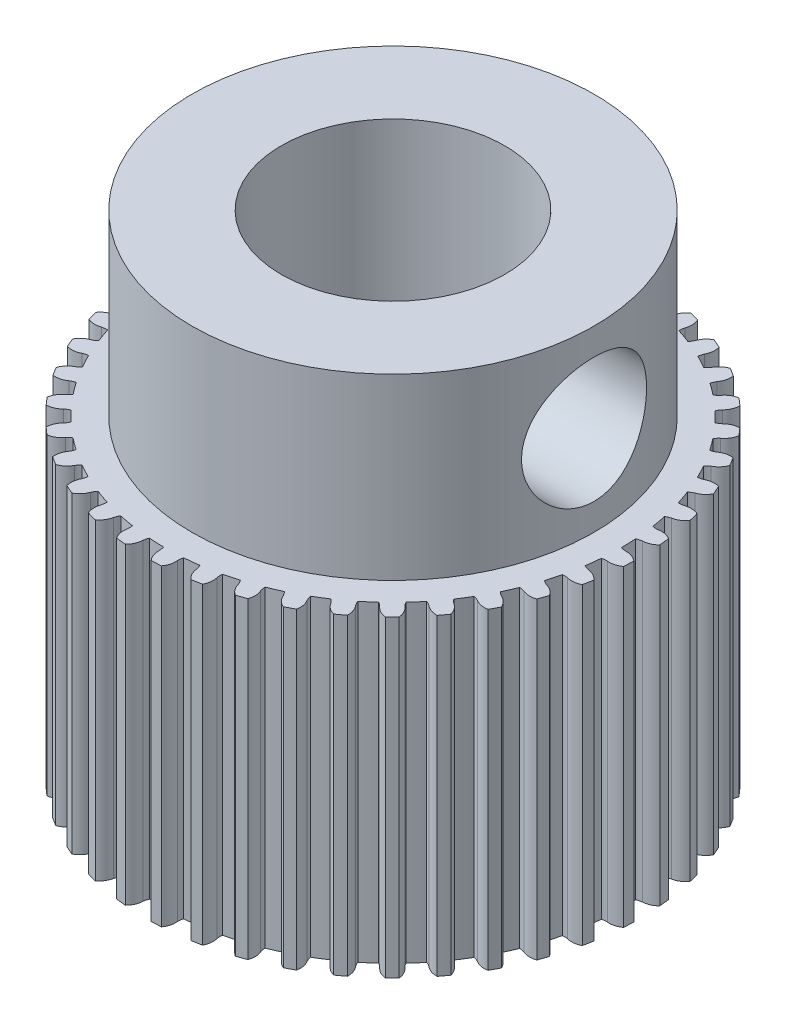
from build123d import *

# Parameters (mm, degrees)
CROQUIS1_R                 = 2.5
SALIENTE_EXTRUIR1_DEPTH    = 7
CROQUIS2_R                 = 4.5
CROQUIS2_R_2               = 2.5
SALIENTE_EXTRUIR2_DEPTH    = 4
CORTAR_EXTRUIR1_REACH      = 17.85
CORTAR_EXTRUIR1_END_RADIUS = 2.5
CROQUIS3_R                 = 1.4


with BuildPart() as part:
    # Croquis1 → Saliente-Extruir1 (new body)
    with BuildSketch(Plane(origin=(0, 0, 0), x_dir=(1, 0, 0), z_dir=(0, 1, 0))):
        with BuildLine():
            ThreePointArc((1.552531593, 4.983279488), (1.541147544, 4.923276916), (1.539030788, 4.86224066))
            ThreePointArc((1.539030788, 4.86224066), (1.694594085, 4.810233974), (1.848404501, 4.753251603))
            ThreePointArc((1.848404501, 4.753251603), (1.885012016, 4.802137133), (1.913750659, 4.856025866))
            ThreePointArc((1.913750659, 4.856025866), (1.989784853, 4.986597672), (2.108829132, 5.079649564))
            ThreePointArc((2.108829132, 5.079649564), (2.210056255, 5.036432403), (2.310398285, 4.991198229))
            ThreePointArc((2.310398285, 4.991198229), (2.322520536, 4.840588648), (2.277910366, 4.696227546))
            ThreePointArc((2.277910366, 4.696227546), (2.257710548, 4.638591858), (2.246520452, 4.578552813))
            ThreePointArc((2.246520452, 4.578552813), (2.392595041, 4.503941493), (2.53619474, 4.424671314))
            ThreePointArc((2.53619474, 4.424671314), (2.57967939, 4.467554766), (2.616128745, 4.516558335))
            ThreePointArc((2.616128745, 4.516558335), (2.710774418, 4.634339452), (2.842357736, 4.708609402))
            ThreePointArc((2.842357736, 4.708609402), (2.936013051, 4.650787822), (3.02849254, 4.591103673))
            ThreePointArc((3.02849254, 4.591103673), (3.018032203, 4.440369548), (2.952404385, 4.304269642))
            ThreePointArc((2.952404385, 4.304269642), (2.923840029, 4.250288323), (2.903826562, 4.192587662))
            ThreePointArc((2.903826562, 4.192587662), (3.037149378, 4.0970384), (3.16733058, 3.99725118))
            ThreePointArc((3.16733058, 3.99725118), (3.216720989, 4.033174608), (3.260066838, 4.076198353))
            ThreePointArc((3.260066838, 4.076198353), (3.371209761, 4.178557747), (3.512392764, 4.232386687))
            ThreePointArc((3.512392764, 4.232386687), (3.596384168, 4.161252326), (3.678935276, 4.088451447))
            ThreePointArc((3.678935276, 4.088451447), (3.646126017, 3.94095993), (3.560946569, 3.816161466))
            ThreePointArc((3.560946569, 3.816161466), (3.524655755, 3.76704037), (3.496265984, 3.71296703))
            ThreePointArc((3.496265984, 3.71296703), (3.613858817, 3.59861424), (3.727713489, 3.480539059))
            ThreePointArc((3.727713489, 3.480539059), (3.781906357, 3.508699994), (3.831180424, 3.544782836))
            ThreePointArc((3.831180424, 3.544782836), (3.95633785, 3.629433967), (4.103966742, 3.661619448))
            ThreePointArc((4.103966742, 3.661619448), (4.176418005, 3.578761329), (4.247196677, 3.494469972))
            ThreePointArc((4.247196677, 3.494469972), (4.1927714, 3.35351578), (4.089943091, 3.242806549))
            ThreePointArc((4.089943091, 3.242806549), (4.046736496, 3.19964296), (4.010604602, 3.150404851))
            ThreePointArc((4.010604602, 3.150404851), (4.109840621, 3.019802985), (4.204825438, 2.886077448))
            ThreePointArc((4.204825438, 2.886077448), (4.262610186, 2.90584682), (4.316711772, 2.934182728))
            ThreePointArc((4.316711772, 2.934182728), (4.453087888, 2.999234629), (4.603864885, 3.00905768))
            ThreePointArc((4.603864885, 3.00905768), (4.663157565, 2.916326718), (4.720582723, 2.822427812))
            ThreePointArc((4.720582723, 2.822427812), (4.6457572, 2.691159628), (4.527577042, 2.597012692))
            ThreePointArc((4.527577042, 2.597012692), (4.478419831, 2.560770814), (4.435352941, 2.517467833))
            ThreePointArc((4.435352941, 2.517467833), (4.514015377, 2.373534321), (4.588008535, 2.227145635))
            ThreePointArc((4.588008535, 2.227145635), (4.648094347, 2.23808183), (4.705814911, 2.258037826))
            ThreePointArc((4.705814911, 2.258037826), (4.850363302, 2.302037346), (5.000920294, 2.289278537))
            ThreePointArc((5.000920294, 2.289278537), (5.045729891, 2.188746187), (5.088518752, 2.087337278))
            ThreePointArc((5.088518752, 2.087337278), (4.99496446, 1.968687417), (4.864072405, 1.893205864))
            ThreePointArc((4.864072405, 1.893205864), (4.810062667, 1.864695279), (4.761022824, 1.828294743))
            ThreePointArc((4.761022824, 1.828294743), (4.817354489, 1.674244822), (4.868703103, 1.518463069))
            ThreePointArc((4.868703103, 1.518463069), (4.929747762, 1.52032179), (4.989797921, 1.531452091))
            ThreePointArc((4.989797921, 1.531452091), (5.139289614, 1.553416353), (5.286263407, 1.518360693))
            ThreePointArc((5.286263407, 1.518360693), (5.315588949, 1.412272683), (5.34278568, 1.305619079))
            ThreePointArc((5.34278568, 1.305619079), (5.232592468, 1.202237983), (5.091912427, 1.147107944))
            ThreePointArc((5.091912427, 1.147107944), (5.034256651, 1.126965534), (4.980339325, 1.098280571))
            ThreePointArc((4.980339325, 1.098280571), (5.013081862, 0.937555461), (5.040638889, 0.775860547))
            ThreePointArc((5.040638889, 0.775860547), (5.101278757, 0.768600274), (5.162317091, 0.770656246))
            ThreePointArc((5.162317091, 0.770656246), (5.313412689, 0.770094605), (5.453520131, 0.713525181))
            ThreePointArc((5.453520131, 0.713525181), (5.466706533, 0.604251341), (5.477703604, 0.494735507))
            ThreePointArc((5.477703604, 0.494735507), (5.353333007, 0.408932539), (5.20600754, 0.375385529))
            ThreePointArc((5.20600754, 0.375385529), (5.145993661, 0.36406124), (5.088403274, 0.343732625))
            ThreePointArc((5.088403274, 0.343732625), (5.09682527, 0.17992266), (5.099975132, 0.015926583))
            ThreePointArc((5.099975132, 0.015926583), (5.158855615, -0.000290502), (5.219518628, -0.007354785))
            ThreePointArc((5.219518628, -0.007354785), (5.368842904, -0.030429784), (5.498954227, -0.107249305))
            ThreePointArc((5.498954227, -0.107249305), (5.495706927, -0.217267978), (5.490258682, -0.327199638))
            ThreePointArc((5.490258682, -0.327199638), (5.354488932, -0.393507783), (5.203809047, -0.404722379))
            ThreePointArc((5.203809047, -0.404722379), (5.142777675, -0.40697558), (5.082800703, -0.41849374))
            ThreePointArc((5.082800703, -0.41849374), (5.066714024, -0.581729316), (5.045386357, -0.744363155))
            ThreePointArc((5.045386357, -0.744363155), (5.101192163, -0.769174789), (5.160124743, -0.785201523))
            ThreePointArc((5.160124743, -0.785201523), (5.304342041, -0.830274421), (5.421550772, -0.925628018))
            ThreePointArc((5.421550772, -0.925628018), (5.401942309, -1.033933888), (5.380170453, -1.141825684))
            ThreePointArc((5.380170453, -1.141825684), (5.236034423, -1.187157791), (5.085366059, -1.175789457))
            ThreePointArc((5.085366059, -1.175789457), (5.024680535, -1.168921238), (4.963656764, -1.171371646))
            ThreePointArc((4.963656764, -1.171371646), (4.923420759, -1.330386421), (4.878091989, -1.48802505))
            ThreePointArc((4.878091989, -1.48802505), (4.929576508, -1.520876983), (4.985462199, -1.545508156))
            ThreePointArc((4.985462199, -1.545508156), (5.121350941, -1.6115721), (5.223038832, -1.723329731))
            ThreePointArc((5.223038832, -1.723329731), (5.187507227, -1.827503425), (5.149898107, -1.930945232))
            ThreePointArc((5.149898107, -1.930945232), (5.000615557, -1.954288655), (4.853324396, -1.920591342))
            ThreePointArc((4.853324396, -1.920591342), (4.794340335, -1.904755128), (4.733632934, -1.898083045))
            ThreePointArc((4.733632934, -1.898083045), (4.67014641, -2.049324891), (4.601829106, -2.198446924))
            ThreePointArc((4.601829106, -2.198446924), (4.647842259, -2.238605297), (4.699432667, -2.271290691))
            ThreePointArc((4.699432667, -2.271290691), (4.823957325, -2.356869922), (4.907852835, -2.482535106))
            ThreePointArc((4.907852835, -2.482535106), (4.857191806, -2.580249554), (4.804585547, -2.676930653))
            ThreePointArc((4.804585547, -2.676930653), (4.653491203, -2.677763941), (4.512867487, -2.62249039))
            ThreePointArc((4.512867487, -2.62249039), (4.456902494, -2.598039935), (4.397867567, -2.582394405))
            ThreePointArc((4.397867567, -2.582394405), (4.312548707, -2.72248483), (4.222768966, -2.859759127))
            ThreePointArc((4.222768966, -2.859759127), (4.262282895, -2.906326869), (4.308425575, -2.946336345))
            ThreePointArc((4.308425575, -2.946336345), (4.418804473, -3.049519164), (4.483033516, -3.186284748))
            ThreePointArc((4.483033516, -3.186284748), (4.418374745, -3.275357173), (4.351946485, -3.363117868))
            ThreePointArc((4.351946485, -3.363117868), (4.202415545, -3.341422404), (4.071600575, -3.265807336))
            ThreePointArc((4.071600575, -3.265807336), (4.019904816, -3.233288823), (3.963861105, -3.209019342))
            ThreePointArc((3.963861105, -3.209019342), (3.858615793, -3.334828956), (3.749379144, -3.457189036))
            ThreePointArc((3.749379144, -3.457189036), (3.781511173, -3.509125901), (3.821175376, -3.555565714))
            ThreePointArc((3.821175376, -3.555565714), (3.914942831, -3.674047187), (3.958070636, -3.818858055))
            ThreePointArc((3.958070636, -3.818858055), (3.880858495, -3.897298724), (3.80209213, -3.974178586))
            ThreePointArc((3.80209213, -3.974178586), (3.657464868, -3.930439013), (3.539380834, -3.836171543))
            ThreePointArc((3.539380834, -3.836171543), (3.493109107, -3.796311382), (3.441308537, -3.763960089))
            ThreePointArc((3.441308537, -3.763960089), (3.318487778, -3.872678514), (3.192234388, -3.977391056))
            ThreePointArc((3.192234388, -3.977391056), (3.216266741, -4.033536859), (3.248566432, -4.08536962))
            ThreePointArc((3.248566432, -4.08536962), (3.323627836, -4.216503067), (3.344690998, -4.366124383))
            ThreePointArc((3.344690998, -4.366124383), (3.256650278, -4.432181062), (3.16730532, -4.496462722))
            ThreePointArc((3.16730532, -4.496462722), (3.03081247, -4.431656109), (2.928097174, -4.320842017))
            ThreePointArc((2.928097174, -4.320842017), (2.888283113, -4.274530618), (2.841882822, -4.234820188))
            ThreePointArc((2.841882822, -4.234820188), (2.704230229, -4.324018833), (2.563780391, -4.408744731))
            ThreePointArc((2.563780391, -4.408744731), (2.579176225, -4.467845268), (2.603389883, -4.52391312))
            ThreePointArc((2.603389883, -4.52391312), (2.658068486, -4.664769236), (2.656596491, -4.815858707))
            ThreePointArc((2.656596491, -4.815858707), (2.559693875, -4.868055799), (2.461766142, -4.918303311))
            ThreePointArc((2.461766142, -4.918303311), (2.33645673, -4.833877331), (2.251404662, -4.70899202))
            ThreePointArc((2.251404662, -4.70899202), (2.218937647, -4.657263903), (2.178974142, -4.611081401))
            ThreePointArc((2.178974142, -4.611081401), (2.029564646, -4.678767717), (1.878055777, -4.741614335))
            ThreePointArc((1.878055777, -4.741614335), (1.884471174, -4.802349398), (1.900057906, -4.861399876))
            ThreePointArc((1.900057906, -4.861399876), (1.933132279, -5.008832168), (1.909158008, -5.158014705))
            ThreePointArc((1.909158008, -5.158014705), (1.805558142, -5.195186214), (1.701235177, -5.230277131))
            ThreePointArc((1.701235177, -5.230277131), (1.589908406, -5.128117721), (1.52441949, -4.991950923))
            ThreePointArc((1.52441949, -4.991950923), (1.50002478, -4.935961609), (1.467390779, -4.884338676))
            ThreePointArc((1.467390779, -4.884338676), (1.309561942, -4.929000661), (1.1503785, -4.968564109))
            ThreePointArc((1.1503785, -4.968564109), (1.147670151, -5.029576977), (1.154281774, -5.090290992))
            ThreePointArc((1.154281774, -5.090290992), (1.165013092, -5.241006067), (1.11907209, -5.384949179))
            ThreePointArc((1.11907209, -5.384949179), (1.011089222, -5.406264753), (0.90270143, -5.425415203))
            ThreePointArc((0.90270143, -5.425415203), (0.807844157, -5.307804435), (0.763381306, -5.163397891))
            ThreePointArc((0.763381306, -5.163397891), (0.747603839, -5.104398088), (0.723028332, -5.048487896))
            ThreePointArc((0.723028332, -5.048487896), (0.560305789, -5.069127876), (0.397003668, -5.084524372))
            ThreePointArc((0.397003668, -5.084524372), (0.385232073, -5.144452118), (0.382720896, -5.205473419))
            ThreePointArc((0.382720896, -5.205473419), (0.370869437, -5.356104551), (0.30398795, -5.491592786))
            ThreePointArc((0.30398795, -5.491592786), (0.194034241, -5.496576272), (0.084002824, -5.499358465))
            ThreePointArc((0.084002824, -5.499358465), (0.007734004, -5.368923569), (-0.014709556, -5.219503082))
            ThreePointArc((-0.014709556, -5.219503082), (-0.021517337, -5.158810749), (-0.037485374, -5.099862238))
            ThreePointArc((-0.037485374, -5.099862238), (-0.20146667, -5.09601915), (-0.36523957, -5.086904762))
            ThreePointArc((-0.36523957, -5.086904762), (-0.385811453, -5.144408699), (-0.397389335, -5.204374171))
            ThreePointArc((-0.397389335, -5.204374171), (-0.431558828, -5.35155651), (-0.517886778, -5.475563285))
            ThreePointArc((-0.517886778, -5.475563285), (-0.627355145, -5.464103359), (-0.736572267, -5.450455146))
            ThreePointArc((-0.736572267, -5.450455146), (-0.792548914, -5.310109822), (-0.79247183, -5.1590132))
            ThreePointArc((-0.79247183, -5.1590132), (-0.790157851, -5.097984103), (-0.797161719, -5.037314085))
            ThreePointArc((-0.797161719, -5.037314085), (-0.958738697, -5.009073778), (-1.119323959, -4.975652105))
            ThreePointArc((-1.119323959, -4.975652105), (-1.148236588, -5.029447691), (-1.168622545, -5.087017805))
            ThreePointArc((-1.168622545, -5.087017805), (-1.224346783, -5.227463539), (-1.328192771, -5.337218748))
            ThreePointArc((-1.328192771, -5.337218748), (-1.434730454, -5.309571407), (-1.54069355, -5.279797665))
            ThreePointArc((-1.54069355, -5.279797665), (-1.575127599, -5.132676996), (-1.552531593, -4.983279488))
            ThreePointArc((-1.552531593, -4.983279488), (-1.541147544, -4.923276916), (-1.539030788, -4.86224066))
            ThreePointArc((-1.539030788, -4.86224066), (-1.694594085, -4.810233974), (-1.848404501, -4.753251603))
            ThreePointArc((-1.848404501, -4.753251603), (-1.885012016, -4.802137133), (-1.913750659, -4.856025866))
            ThreePointArc((-1.913750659, -4.856025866), (-1.989784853, -4.986597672), (-2.108829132, -5.079649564))
            ThreePointArc((-2.108829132, -5.079649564), (-2.210056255, -5.036432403), (-2.310398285, -4.991198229))
            ThreePointArc((-2.310398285, -4.991198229), (-2.322520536, -4.840588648), (-2.277910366, -4.696227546))
            ThreePointArc((-2.277910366, -4.696227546), (-2.257710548, -4.638591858), (-2.246520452, -4.578552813))
            ThreePointArc((-2.246520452, -4.578552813), (-2.392595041, -4.503941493), (-2.53619474, -4.424671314))
            ThreePointArc((-2.53619474, -4.424671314), (-2.57967939, -4.467554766), (-2.616128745, -4.516558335))
            ThreePointArc((-2.616128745, -4.516558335), (-2.710774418, -4.634339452), (-2.842357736, -4.708609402))
            ThreePointArc((-2.842357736, -4.708609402), (-2.936013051, -4.650787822), (-3.02849254, -4.591103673))
            ThreePointArc((-3.02849254, -4.591103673), (-3.018032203, -4.440369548), (-2.952404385, -4.304269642))
            ThreePointArc((-2.952404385, -4.304269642), (-2.923840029, -4.250288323), (-2.903826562, -4.192587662))
            ThreePointArc((-2.903826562, -4.192587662), (-3.037149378, -4.0970384), (-3.16733058, -3.99725118))
            ThreePointArc((-3.16733058, -3.99725118), (-3.216720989, -4.033174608), (-3.260066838, -4.076198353))
            ThreePointArc((-3.260066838, -4.076198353), (-3.371209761, -4.178557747), (-3.512392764, -4.232386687))
            ThreePointArc((-3.512392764, -4.232386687), (-3.596384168, -4.161252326), (-3.678935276, -4.088451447))
            ThreePointArc((-3.678935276, -4.088451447), (-3.646126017, -3.94095993), (-3.560946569, -3.816161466))
            ThreePointArc((-3.560946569, -3.816161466), (-3.524655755, -3.76704037), (-3.496265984, -3.71296703))
            ThreePointArc((-3.496265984, -3.71296703), (-3.613858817, -3.59861424), (-3.727713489, -3.480539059))
            ThreePointArc((-3.727713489, -3.480539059), (-3.781906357, -3.508699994), (-3.831180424, -3.544782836))
            ThreePointArc((-3.831180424, -3.544782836), (-3.95633785, -3.629433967), (-4.103966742, -3.661619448))
            ThreePointArc((-4.103966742, -3.661619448), (-4.176418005, -3.578761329), (-4.247196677, -3.494469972))
            ThreePointArc((-4.247196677, -3.494469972), (-4.1927714, -3.35351578), (-4.089943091, -3.242806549))
            ThreePointArc((-4.089943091, -3.242806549), (-4.046736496, -3.19964296), (-4.010604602, -3.150404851))
            ThreePointArc((-4.010604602, -3.150404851), (-4.109840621, -3.019802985), (-4.204825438, -2.886077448))
            ThreePointArc((-4.204825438, -2.886077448), (-4.262610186, -2.90584682), (-4.316711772, -2.934182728))
            ThreePointArc((-4.316711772, -2.934182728), (-4.453087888, -2.999234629), (-4.603864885, -3.00905768))
            ThreePointArc((-4.603864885, -3.00905768), (-4.663157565, -2.916326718), (-4.720582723, -2.822427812))
            ThreePointArc((-4.720582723, -2.822427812), (-4.6457572, -2.691159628), (-4.527577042, -2.597012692))
            ThreePointArc((-4.527577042, -2.597012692), (-4.478419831, -2.560770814), (-4.435352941, -2.517467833))
            ThreePointArc((-4.435352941, -2.517467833), (-4.514015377, -2.373534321), (-4.588008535, -2.227145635))
            ThreePointArc((-4.588008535, -2.227145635), (-4.648094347, -2.23808183), (-4.705814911, -2.258037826))
            ThreePointArc((-4.705814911, -2.258037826), (-4.850363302, -2.302037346), (-5.000920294, -2.289278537))
            ThreePointArc((-5.000920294, -2.289278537), (-5.045729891, -2.188746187), (-5.088518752, -2.087337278))
            ThreePointArc((-5.088518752, -2.087337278), (-4.99496446, -1.968687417), (-4.864072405, -1.893205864))
            ThreePointArc((-4.864072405, -1.893205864), (-4.810062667, -1.864695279), (-4.761022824, -1.828294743))
            ThreePointArc((-4.761022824, -1.828294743), (-4.817354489, -1.674244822), (-4.868703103, -1.518463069))
            ThreePointArc((-4.868703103, -1.518463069), (-4.929747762, -1.52032179), (-4.989797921, -1.531452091))
            ThreePointArc((-4.989797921, -1.531452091), (-5.139289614, -1.553416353), (-5.286263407, -1.518360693))
            ThreePointArc((-5.286263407, -1.518360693), (-5.315588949, -1.412272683), (-5.34278568, -1.305619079))
            ThreePointArc((-5.34278568, -1.305619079), (-5.232592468, -1.202237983), (-5.091912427, -1.147107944))
            ThreePointArc((-5.091912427, -1.147107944), (-5.034256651, -1.126965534), (-4.980339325, -1.098280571))
            ThreePointArc((-4.980339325, -1.098280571), (-5.013081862, -0.937555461), (-5.040638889, -0.775860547))
            ThreePointArc((-5.040638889, -0.775860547), (-5.101278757, -0.768600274), (-5.162317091, -0.770656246))
            ThreePointArc((-5.162317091, -0.770656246), (-5.313412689, -0.770094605), (-5.453520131, -0.713525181))
            ThreePointArc((-5.453520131, -0.713525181), (-5.466706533, -0.604251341), (-5.477703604, -0.494735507))
            ThreePointArc((-5.477703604, -0.494735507), (-5.353333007, -0.408932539), (-5.20600754, -0.375385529))
            ThreePointArc((-5.20600754, -0.375385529), (-5.145993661, -0.36406124), (-5.088403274, -0.343732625))
            ThreePointArc((-5.088403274, -0.343732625), (-5.09682527, -0.17992266), (-5.099975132, -0.015926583))
            ThreePointArc((-5.099975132, -0.015926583), (-5.158855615, 0.000290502), (-5.219518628, 0.007354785))
            ThreePointArc((-5.219518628, 0.007354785), (-5.368842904, 0.030429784), (-5.498954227, 0.107249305))
            ThreePointArc((-5.498954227, 0.107249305), (-5.495706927, 0.217267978), (-5.490258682, 0.327199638))
            ThreePointArc((-5.490258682, 0.327199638), (-5.354488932, 0.393507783), (-5.203809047, 0.404722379))
            ThreePointArc((-5.203809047, 0.404722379), (-5.142777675, 0.40697558), (-5.082800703, 0.41849374))
            ThreePointArc((-5.082800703, 0.41849374), (-5.066714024, 0.581729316), (-5.045386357, 0.744363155))
            ThreePointArc((-5.045386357, 0.744363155), (-5.101192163, 0.769174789), (-5.160124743, 0.785201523))
            ThreePointArc((-5.160124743, 0.785201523), (-5.304342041, 0.830274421), (-5.421550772, 0.925628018))
            ThreePointArc((-5.421550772, 0.925628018), (-5.401942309, 1.033933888), (-5.380170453, 1.141825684))
            ThreePointArc((-5.380170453, 1.141825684), (-5.236034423, 1.187157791), (-5.085366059, 1.175789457))
            ThreePointArc((-5.085366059, 1.175789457), (-5.024680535, 1.168921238), (-4.963656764, 1.171371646))
            ThreePointArc((-4.963656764, 1.171371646), (-4.923420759, 1.330386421), (-4.878091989, 1.48802505))
            ThreePointArc((-4.878091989, 1.48802505), (-4.929576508, 1.520876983), (-4.985462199, 1.545508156))
            ThreePointArc((-4.985462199, 1.545508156), (-5.121350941, 1.6115721), (-5.223038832, 1.723329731))
            ThreePointArc((-5.223038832, 1.723329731), (-5.187507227, 1.827503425), (-5.149898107, 1.930945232))
            ThreePointArc((-5.149898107, 1.930945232), (-5.000615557, 1.954288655), (-4.853324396, 1.920591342))
            ThreePointArc((-4.853324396, 1.920591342), (-4.794340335, 1.904755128), (-4.733632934, 1.898083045))
            ThreePointArc((-4.733632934, 1.898083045), (-4.67014641, 2.049324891), (-4.601829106, 2.198446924))
            ThreePointArc((-4.601829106, 2.198446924), (-4.647842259, 2.238605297), (-4.699432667, 2.271290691))
            ThreePointArc((-4.699432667, 2.271290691), (-4.823957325, 2.356869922), (-4.907852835, 2.482535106))
            ThreePointArc((-4.907852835, 2.482535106), (-4.857191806, 2.580249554), (-4.804585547, 2.676930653))
            ThreePointArc((-4.804585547, 2.676930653), (-4.653491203, 2.677763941), (-4.512867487, 2.62249039))
            ThreePointArc((-4.512867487, 2.62249039), (-4.456902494, 2.598039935), (-4.397867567, 2.582394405))
            ThreePointArc((-4.397867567, 2.582394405), (-4.312548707, 2.72248483), (-4.222768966, 2.859759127))
            ThreePointArc((-4.222768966, 2.859759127), (-4.262282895, 2.906326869), (-4.308425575, 2.946336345))
            ThreePointArc((-4.308425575, 2.946336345), (-4.418804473, 3.049519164), (-4.483033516, 3.186284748))
            ThreePointArc((-4.483033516, 3.186284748), (-4.418374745, 3.275357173), (-4.351946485, 3.363117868))
            ThreePointArc((-4.351946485, 3.363117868), (-4.202415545, 3.341422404), (-4.071600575, 3.265807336))
            ThreePointArc((-4.071600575, 3.265807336), (-4.019904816, 3.233288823), (-3.963861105, 3.209019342))
            ThreePointArc((-3.963861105, 3.209019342), (-3.858615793, 3.334828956), (-3.749379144, 3.457189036))
            ThreePointArc((-3.749379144, 3.457189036), (-3.781511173, 3.509125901), (-3.821175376, 3.555565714))
            ThreePointArc((-3.821175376, 3.555565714), (-3.914942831, 3.674047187), (-3.958070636, 3.818858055))
            ThreePointArc((-3.958070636, 3.818858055), (-3.880858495, 3.897298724), (-3.80209213, 3.974178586))
            ThreePointArc((-3.80209213, 3.974178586), (-3.657464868, 3.930439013), (-3.539380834, 3.836171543))
            ThreePointArc((-3.539380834, 3.836171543), (-3.493109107, 3.796311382), (-3.441308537, 3.763960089))
            ThreePointArc((-3.441308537, 3.763960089), (-3.318487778, 3.872678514), (-3.192234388, 3.977391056))
            ThreePointArc((-3.192234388, 3.977391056), (-3.216266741, 4.033536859), (-3.248566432, 4.08536962))
            ThreePointArc((-3.248566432, 4.08536962), (-3.323627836, 4.216503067), (-3.344690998, 4.366124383))
            ThreePointArc((-3.344690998, 4.366124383), (-3.256650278, 4.432181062), (-3.16730532, 4.496462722))
            ThreePointArc((-3.16730532, 4.496462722), (-3.03081247, 4.431656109), (-2.928097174, 4.320842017))
            ThreePointArc((-2.928097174, 4.320842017), (-2.888283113, 4.274530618), (-2.841882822, 4.234820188))
            ThreePointArc((-2.841882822, 4.234820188), (-2.704230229, 4.324018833), (-2.563780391, 4.408744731))
            ThreePointArc((-2.563780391, 4.408744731), (-2.579176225, 4.467845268), (-2.603389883, 4.52391312))
            ThreePointArc((-2.603389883, 4.52391312), (-2.658068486, 4.664769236), (-2.656596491, 4.815858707))
            ThreePointArc((-2.656596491, 4.815858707), (-2.559693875, 4.868055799), (-2.461766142, 4.918303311))
            ThreePointArc((-2.461766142, 4.918303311), (-2.33645673, 4.833877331), (-2.251404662, 4.70899202))
            ThreePointArc((-2.251404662, 4.70899202), (-2.218937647, 4.657263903), (-2.178974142, 4.611081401))
            ThreePointArc((-2.178974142, 4.611081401), (-2.029564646, 4.678767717), (-1.878055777, 4.741614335))
            ThreePointArc((-1.878055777, 4.741614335), (-1.884471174, 4.802349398), (-1.900057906, 4.861399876))
            ThreePointArc((-1.900057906, 4.861399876), (-1.933132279, 5.008832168), (-1.909158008, 5.158014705))
            ThreePointArc((-1.909158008, 5.158014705), (-1.805558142, 5.195186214), (-1.701235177, 5.230277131))
            ThreePointArc((-1.701235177, 5.230277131), (-1.589908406, 5.128117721), (-1.52441949, 4.991950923))
            ThreePointArc((-1.52441949, 4.991950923), (-1.50002478, 4.935961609), (-1.467390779, 4.884338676))
            ThreePointArc((-1.467390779, 4.884338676), (-1.309561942, 4.929000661), (-1.1503785, 4.968564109))
            ThreePointArc((-1.1503785, 4.968564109), (-1.147670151, 5.029576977), (-1.154281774, 5.090290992))
            ThreePointArc((-1.154281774, 5.090290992), (-1.165013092, 5.241006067), (-1.11907209, 5.384949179))
            ThreePointArc((-1.11907209, 5.384949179), (-1.011089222, 5.406264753), (-0.90270143, 5.425415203))
            ThreePointArc((-0.90270143, 5.425415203), (-0.807844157, 5.307804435), (-0.763381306, 5.163397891))
            ThreePointArc((-0.763381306, 5.163397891), (-0.747603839, 5.104398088), (-0.723028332, 5.048487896))
            ThreePointArc((-0.723028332, 5.048487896), (-0.560305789, 5.069127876), (-0.397003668, 5.084524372))
            ThreePointArc((-0.397003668, 5.084524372), (-0.385232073, 5.144452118), (-0.382720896, 5.205473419))
            ThreePointArc((-0.382720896, 5.205473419), (-0.370869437, 5.356104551), (-0.30398795, 5.491592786))
            ThreePointArc((-0.30398795, 5.491592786), (-0.194034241, 5.496576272), (-0.084002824, 5.499358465))
            ThreePointArc((-0.084002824, 5.499358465), (-0.007734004, 5.368923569), (0.014709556, 5.219503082))
            ThreePointArc((0.014709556, 5.219503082), (0.021517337, 5.158810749), (0.037485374, 5.099862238))
            ThreePointArc((0.037485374, 5.099862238), (0.20146667, 5.09601915), (0.36523957, 5.086904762))
            ThreePointArc((0.36523957, 5.086904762), (0.385811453, 5.144408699), (0.397389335, 5.204374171))
            ThreePointArc((0.397389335, 5.204374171), (0.431558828, 5.35155651), (0.517886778, 5.475563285))
            ThreePointArc((0.517886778, 5.475563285), (0.627355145, 5.464103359), (0.736572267, 5.450455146))
            ThreePointArc((0.736572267, 5.450455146), (0.792548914, 5.310109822), (0.79247183, 5.1590132))
            ThreePointArc((0.79247183, 5.1590132), (0.790157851, 5.097984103), (0.797161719, 5.037314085))
            ThreePointArc((0.797161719, 5.037314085), (0.958738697, 5.009073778), (1.119323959, 4.975652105))
            ThreePointArc((1.119323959, 4.975652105), (1.148236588, 5.029447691), (1.168622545, 5.087017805))
            ThreePointArc((1.168622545, 5.087017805), (1.224346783, 5.227463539), (1.328192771, 5.337218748))
            ThreePointArc((1.328192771, 5.337218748), (1.434730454, 5.309571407), (1.54069355, 5.279797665))
            ThreePointArc((1.54069355, 5.279797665), (1.575127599, 5.132676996), (1.552531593, 4.983279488))
        make_face()
        with Locations(Location((0, 0, 0), (0, 0, 270))):
            Circle(CROQUIS1_R, mode=Mode.SUBTRACT)
    extrude(amount=SALIENTE_EXTRUIR1_DEPTH)

    # Croquis2 → Saliente-Extruir2 (add)
    with BuildSketch(Plane(origin=(0, 7, 0), x_dir=(1, 0, 0), z_dir=(0, 1, 0))):
        with Locations(Location((0, 0, 0), (0, 0, 270))):
            Circle(CROQUIS2_R)
        with Locations(Location((0, 0, 0), (0, 0, 270))):
            Circle(CROQUIS2_R_2, mode=Mode.SUBTRACT)
    extrude(amount=SALIENTE_EXTRUIR2_DEPTH)

    # Cortar-Extruir1: up to this cylinder (the profile starts outside it)
    cortar_extruir1_end = Plane(origin=(0, 9, 0), z_dir=(0, -1, 0)) * Cylinder(CORTAR_EXTRUIR1_END_RADIUS, 41.7, mode=Mode.PRIVATE)
    # Croquis3 → Cortar-Extruir1 (cut, up to the surface)
    with BuildSketch(Plane(origin=(4.5, 0, 0), x_dir=(0, 0, -1), z_dir=(1, 0, 0)), mode=Mode.PRIVATE) as cortar_extruir1_sk1:
        with Locations((0, 9)):
            Circle(CROQUIS3_R)
    cortar_extruir1_tool1 = extrude(cortar_extruir1_sk1.sketch, amount=-CORTAR_EXTRUIR1_REACH, mode=Mode.PRIVATE) - cortar_extruir1_end
    add(cortar_extruir1_tool1.solids().sort_by_distance((4.5, 9, 0))[0], mode=Mode.SUBTRACT)


solid = part.part
